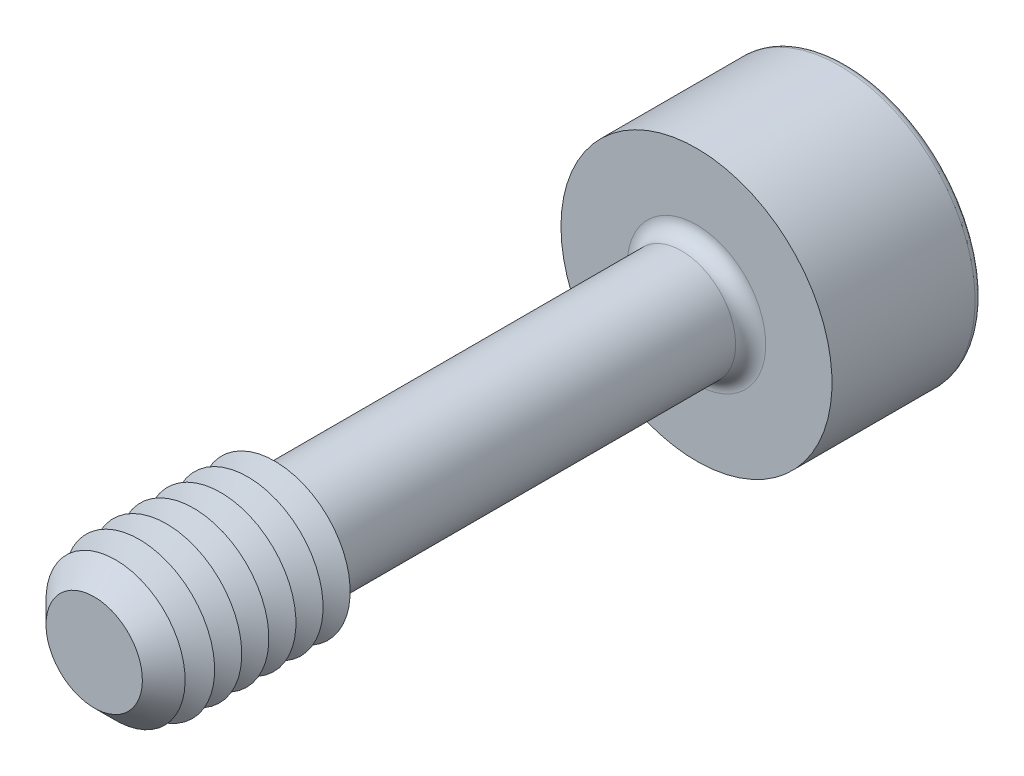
from build123d import *

# Parameters (mm, degrees)
SKETCH1_R       = 0.9
EXTRUDE1_DEPTH  = 5
CHAMFER1_SIZE   = 0.45
SKETCH3_R       = 2.25
EXTRUDE2_DEPTH  = 2.5
EXTRUDE3_DEPTH  = 2
FILLET1_R       = 0.25
FILLET2_R       = 0.125
LPATTERN1_COUNT = 6
LPATTERN1_PITCH = 0.45


with BuildPart() as part:
    # Sketch1 → Extrude1 (new, symmetric)
    with BuildSketch(Plane.XY):
        Circle(SKETCH1_R)
    extrude(amount=EXTRUDE1_DEPTH, both=True)

    # Sketch2 → Revolve1 (revolve)
    with BuildSketch(Plane(origin=(0, 0, 0), x_dir=(0, 0, -1), z_dir=(1, 0, 0))):
        Polygon((-5, 0), (-5, 1.25), (-2, 1.25), (-1.797927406, 0.9), (-1.797927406, 0), align=None)
    revolve(axis=Axis((0, 0, 1.797927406), (0, 0, 1)))

    # Chamfer1
    chamfer1_edges = [part.edges().sort_by_distance(p)[0] for p in [
        (0, -1.25, 5),
    ]]
    chamfer(chamfer1_edges, length=CHAMFER1_SIZE)

    # Sketch3 → Extrude2 (add)
    with BuildSketch(Plane(origin=(0, 0, -5), x_dir=(-1, 0, 0), z_dir=(0, 0, -1))):
        Circle(SKETCH3_R)
    extrude(amount=EXTRUDE2_DEPTH)

    # Sketch4 → Extrude3 (cut)
    with BuildSketch(Plane(origin=(-13.7, 0, -7.5), x_dir=(1, 0, 0), z_dir=(0, 0, 1))):
        Polygon((13.122649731, -1), (14.277350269, -1), (14.854700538, 0), (14.277350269, 1), (13.122649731, 1), (12.545299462, 0), align=None)
    extrude(amount=EXTRUDE3_DEPTH, mode=Mode.SUBTRACT)

    # Fillet1
    fillet1_edges = [part.edges().sort_by_distance(p)[0] for p in [
        (-0.9, 0, -5),
    ]]
    fillet(fillet1_edges, radius=FILLET1_R)

    # Fillet2
    fillet2_edges = [part.edges().sort_by_distance(p)[0] for p in [
        (2.25, 0, -7.5),
    ]]
    fillet(fillet2_edges, radius=FILLET2_R)

    # Sketch5 → Cut-Revolve1 (revolve, cut)
    with BuildSketch(Plane(origin=(0, 0, 0), x_dir=(0, 0, -1), z_dir=(1, 0, 0)), mode=Mode.PRIVATE) as cut_revolve1_sk:
        Polygon((5.5, 0), (5.5, -1), (4.922649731, 0), align=None)
    revolve(cut_revolve1_sk.sketch.rotate(Axis((0, 0, -4.922649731), (0, 0, -1)), 90), axis=Axis((0, 0, -4.922649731), (0, 0, -1)), mode=Mode.SUBTRACT)

    # Sketch7 → Cut-Revolve2 (revolve, cut)
    with BuildSketch(Plane(origin=(0, 0, 0), x_dir=(0, 0, -1), z_dir=(1, 0, 0)), mode=Mode.PRIVATE) as cut_revolve2_sk:
        Polygon((-2, 1.25), (-2.225, 0.860288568), (-2.45, 1.25), align=None)
    cut_revolve2 = revolve(cut_revolve2_sk.sketch.rotate(Axis((0, 0, -1.332048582), (0, 0, 1)), 90), axis=Axis((0, 0, -1.332048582), (0, 0, 1)), mode=Mode.SUBTRACT)

    # LPattern1: Cut-Revolve2 ×6
    with Locations(*[(0, 0, i * LPATTERN1_PITCH) for i in range(1, LPATTERN1_COUNT)]):
        add(cut_revolve2, mode=Mode.SUBTRACT)


solid = part.part
